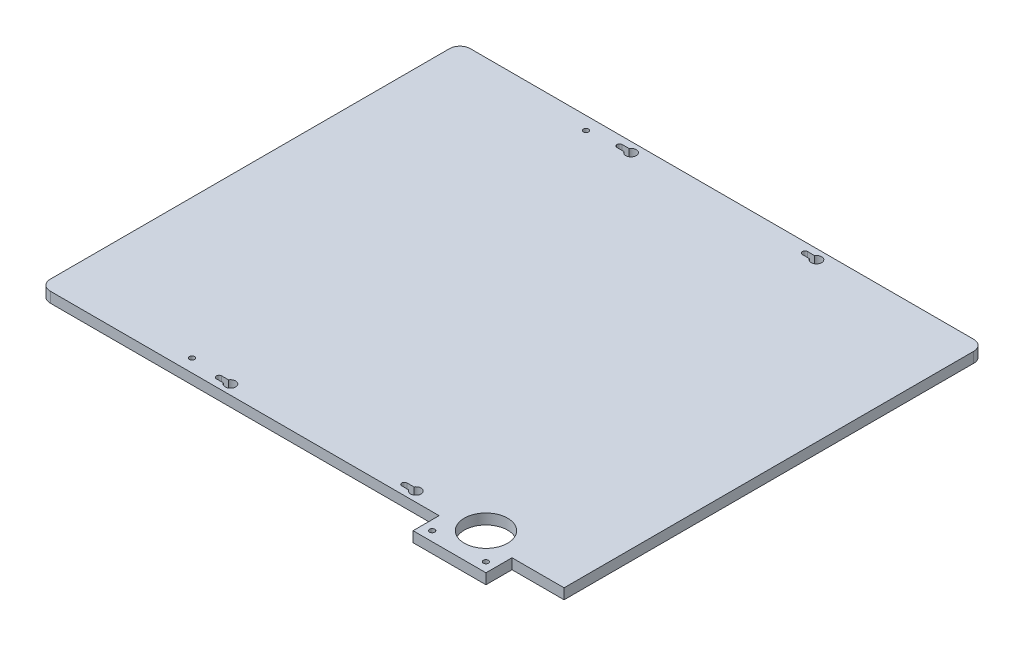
ISO-10303-21;
HEADER;
FILE_DESCRIPTION(('STEP AP214'),'2;1');
FILE_NAME('part.step','',(''),(''),'','','');
FILE_SCHEMA(('AUTOMOTIVE_DESIGN { 1 0 10303 214 1 1 1 1 }'));
ENDSEC;
DATA;
#1=APPLICATION_CONTEXT('core data for automotive mechanical design processes');
#2=APPLICATION_PROTOCOL_DEFINITION('international standard','automotive_design',2000,#1);
#3=PRODUCT_CONTEXT('',#1,'mechanical');
#4=PRODUCT('Part','Part','',(#3));
#5=PRODUCT_RELATED_PRODUCT_CATEGORY('part','',(#4));
#6=PRODUCT_DEFINITION_FORMATION('','',#4);
#7=PRODUCT_DEFINITION_CONTEXT('part definition',#1,'design');
#8=PRODUCT_DEFINITION('design','',#6,#7);
#9=PRODUCT_DEFINITION_SHAPE('','',#8);
#10=(LENGTH_UNIT() NAMED_UNIT(*) SI_UNIT(.MILLI.,.METRE.));
#11=(NAMED_UNIT(*) PLANE_ANGLE_UNIT() SI_UNIT($,.RADIAN.));
#12=(NAMED_UNIT(*) SI_UNIT($,.STERADIAN.) SOLID_ANGLE_UNIT());
#13=UNCERTAINTY_MEASURE_WITH_UNIT(LENGTH_MEASURE(1.E-05),#10,'distance_accuracy_value','');
#14=(GEOMETRIC_REPRESENTATION_CONTEXT(3) GLOBAL_UNCERTAINTY_ASSIGNED_CONTEXT((#13)) GLOBAL_UNIT_ASSIGNED_CONTEXT((#10,
#11,#12)) REPRESENTATION_CONTEXT('',''));
#15=CARTESIAN_POINT('',(0.,0.,0.));
#16=DIRECTION('',(0.,0.,1.));
#17=DIRECTION('',(1.,0.,0.));
#18=AXIS2_PLACEMENT_3D('',#15,#16,#17);
#19=CARTESIAN_POINT('',(0.,-3.,0.));
#20=DIRECTION('',(0.,1.,0.));
#21=DIRECTION('',(0.,0.,1.));
#22=AXIS2_PLACEMENT_3D('',#19,#20,#21);
#23=PLANE('',#22);
#24=DIRECTION('',(1.,0.,0.));
#25=VECTOR('',#24,1.);
#26=CARTESIAN_POINT('',(53.4,-3.,116.9));
#27=LINE('',#26,#25);
#28=CARTESIAN_POINT('',(53.4,-3.,116.9));
#29=VERTEX_POINT('',#28);
#30=CARTESIAN_POINT('',(57.4019237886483,-3.,116.9));
#31=VERTEX_POINT('',#30);
#32=EDGE_CURVE('E263',#29,#31,#27,.T.);
#33=ORIENTED_EDGE('',*,*,#32,.T.);
#34=CARTESIAN_POINT('',(60.,-3.,115.4));
#35=DIRECTION('',(0.,-1.,0.));
#36=DIRECTION('',(0.,0.,-1.));
#37=AXIS2_PLACEMENT_3D('',#34,#35,#36);
#38=CIRCLE('',#37,2.99999999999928);
#39=CARTESIAN_POINT('',(57.4019237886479,-3.,113.899999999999));
#40=VERTEX_POINT('',#39);
#41=EDGE_CURVE('E822',#40,#31,#38,.T.);
#42=ORIENTED_EDGE('',*,*,#41,.F.);
#43=DIRECTION('',(-1.,0.,1.8032451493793E-13));
#44=VECTOR('',#43,1.);
#45=CARTESIAN_POINT('',(57.4019237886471,-3.,113.899999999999));
#46=LINE('',#45,#44);
#47=CARTESIAN_POINT('',(53.4,-3.,113.9));
#48=VERTEX_POINT('',#47);
#49=EDGE_CURVE('E259',#40,#48,#46,.T.);
#50=ORIENTED_EDGE('',*,*,#49,.T.);
#51=CARTESIAN_POINT('',(53.4,-3.,115.4));
#52=DIRECTION('',(0.,1.,0.));
#53=DIRECTION('',(0.,0.,1.));
#54=AXIS2_PLACEMENT_3D('',#51,#52,#53);
#55=CIRCLE('',#54,1.5);
#56=EDGE_CURVE('E272',#48,#29,#55,.T.);
#57=ORIENTED_EDGE('',*,*,#56,.T.);
#58=EDGE_LOOP('',(#33,#42,#50,#57));
#59=FACE_BOUND('',#58,.T.);
#60=DIRECTION('',(1.,0.,0.));
#61=VECTOR('',#60,1.);
#62=CARTESIAN_POINT('',(53.4,-3.,-113.9));
#63=LINE('',#62,#61);
#64=CARTESIAN_POINT('',(53.4,-3.,-113.9));
#65=VERTEX_POINT('',#64);
#66=CARTESIAN_POINT('',(57.4019237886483,-3.,-113.9));
#67=VERTEX_POINT('',#66);
#68=EDGE_CURVE('E315',#65,#67,#63,.T.);
#69=ORIENTED_EDGE('',*,*,#68,.T.);
#70=CARTESIAN_POINT('',(60.,-3.,-115.4));
#71=DIRECTION('',(0.,-1.,0.));
#72=DIRECTION('',(0.,0.,-1.));
#73=AXIS2_PLACEMENT_3D('',#70,#71,#72);
#74=CIRCLE('',#73,2.99999999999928);
#75=CARTESIAN_POINT('',(57.4019237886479,-3.,-116.900000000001));
#76=VERTEX_POINT('',#75);
#77=EDGE_CURVE('E806',#76,#67,#74,.T.);
#78=ORIENTED_EDGE('',*,*,#77,.F.);
#79=DIRECTION('',(-1.,0.,1.8032451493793E-13));
#80=VECTOR('',#79,1.);
#81=CARTESIAN_POINT('',(57.4019237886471,-3.,-116.900000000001));
#82=LINE('',#81,#80);
#83=CARTESIAN_POINT('',(53.4,-3.,-116.9));
#84=VERTEX_POINT('',#83);
#85=EDGE_CURVE('E311',#76,#84,#82,.T.);
#86=ORIENTED_EDGE('',*,*,#85,.T.);
#87=CARTESIAN_POINT('',(53.4,-3.,-115.4));
#88=DIRECTION('',(0.,1.,0.));
#89=DIRECTION('',(0.,0.,1.));
#90=AXIS2_PLACEMENT_3D('',#87,#88,#89);
#91=CIRCLE('',#90,1.5);
#92=EDGE_CURVE('E324',#84,#65,#91,.T.);
#93=ORIENTED_EDGE('',*,*,#92,.T.);
#94=EDGE_LOOP('',(#69,#78,#86,#93));
#95=FACE_BOUND('',#94,.T.);
#96=DIRECTION('',(-1.,0.,0.));
#97=VECTOR('',#96,1.);
#98=CARTESIAN_POINT('',(0.,-3.,-121.));
#99=LINE('',#98,#97);
#100=CARTESIAN_POINT('',(145.,-3.,-121.));
#101=VERTEX_POINT('',#100);
#102=CARTESIAN_POINT('',(-145.,-3.,-121.));
#103=VERTEX_POINT('',#102);
#104=EDGE_CURVE('E348',#101,#103,#99,.T.);
#105=ORIENTED_EDGE('',*,*,#104,.F.);
#106=CARTESIAN_POINT('',(145.,-3.,-115.));
#107=DIRECTION('',(0.,1.,0.));
#108=DIRECTION('',(0.,0.,1.));
#109=AXIS2_PLACEMENT_3D('',#106,#107,#108);
#110=CIRCLE('',#109,6.);
#111=CARTESIAN_POINT('',(151.,-3.,-115.));
#112=VERTEX_POINT('',#111);
#113=EDGE_CURVE('E437',#101,#112,#110,.F.);
#114=ORIENTED_EDGE('',*,*,#113,.T.);
#115=DIRECTION('',(0.,0.,1.));
#116=VECTOR('',#115,1.);
#117=CARTESIAN_POINT('',(151.,-3.,0.));
#118=LINE('',#117,#116);
#119=CARTESIAN_POINT('',(151.,-3.,121.));
#120=VERTEX_POINT('',#119);
#121=EDGE_CURVE('E345',#112,#120,#118,.T.);
#122=ORIENTED_EDGE('',*,*,#121,.T.);
#123=DIRECTION('',(1.,0.,0.));
#124=VECTOR('',#123,1.);
#125=CARTESIAN_POINT('',(0.,-3.,121.));
#126=LINE('',#125,#124);
#127=CARTESIAN_POINT('',(121.,-3.,121.));
#128=VERTEX_POINT('',#127);
#129=EDGE_CURVE('E341',#128,#120,#126,.T.);
#130=ORIENTED_EDGE('',*,*,#129,.F.);
#131=DIRECTION('',(0.,0.,1.));
#132=VECTOR('',#131,1.);
#133=CARTESIAN_POINT('',(121.,-3.,0.));
#134=LINE('',#133,#132);
#135=CARTESIAN_POINT('',(121.,-3.,136.));
#136=VERTEX_POINT('',#135);
#137=EDGE_CURVE('E338',#128,#136,#134,.T.);
#138=ORIENTED_EDGE('',*,*,#137,.T.);
#139=DIRECTION('',(-1.,0.,0.));
#140=VECTOR('',#139,1.);
#141=CARTESIAN_POINT('',(0.,-3.,136.));
#142=LINE('',#141,#140);
#143=CARTESIAN_POINT('',(79.,-3.,136.));
#144=VERTEX_POINT('',#143);
#145=EDGE_CURVE('E356',#136,#144,#142,.T.);
#146=ORIENTED_EDGE('',*,*,#145,.T.);
#147=DIRECTION('',(0.,0.,1.));
#148=VECTOR('',#147,1.);
#149=CARTESIAN_POINT('',(78.9999999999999,-3.,0.));
#150=LINE('',#149,#148);
#151=CARTESIAN_POINT('',(79.,-3.,121.));
#152=VERTEX_POINT('',#151);
#153=EDGE_CURVE('E353',#152,#144,#150,.T.);
#154=ORIENTED_EDGE('',*,*,#153,.F.);
#155=CARTESIAN_POINT('',(-145.,-3.,121.));
#156=VERTEX_POINT('',#155);
#157=EDGE_CURVE('E346',#156,#152,#126,.T.);
#158=ORIENTED_EDGE('',*,*,#157,.F.);
#159=CARTESIAN_POINT('',(-145.,-3.,115.));
#160=DIRECTION('',(0.,1.,0.));
#161=DIRECTION('',(0.,0.,1.));
#162=AXIS2_PLACEMENT_3D('',#159,#160,#161);
#163=CIRCLE('',#162,6.);
#164=CARTESIAN_POINT('',(-151.,-3.,115.));
#165=VERTEX_POINT('',#164);
#166=EDGE_CURVE('E52',#156,#165,#163,.F.);
#167=ORIENTED_EDGE('',*,*,#166,.T.);
#168=DIRECTION('',(0.,0.,1.));
#169=VECTOR('',#168,1.);
#170=CARTESIAN_POINT('',(-151.,-3.,0.));
#171=LINE('',#170,#169);
#172=CARTESIAN_POINT('',(-151.,-3.,-115.));
#173=VERTEX_POINT('',#172);
#174=EDGE_CURVE('E351',#173,#165,#171,.T.);
#175=ORIENTED_EDGE('',*,*,#174,.F.);
#176=CARTESIAN_POINT('',(-145.,-3.,-115.));
#177=DIRECTION('',(0.,1.,0.));
#178=DIRECTION('',(0.,0.,1.));
#179=AXIS2_PLACEMENT_3D('',#176,#177,#178);
#180=CIRCLE('',#179,6.);
#181=EDGE_CURVE('E434',#173,#103,#180,.F.);
#182=ORIENTED_EDGE('',*,*,#181,.T.);
#183=EDGE_LOOP('',(#105,#114,#122,#130,#138,#146,#154,#158,#167,#175,#182));
#184=FACE_BOUND('',#183,.T.);
#185=CARTESIAN_POINT('',(100.,-3.,115.));
#186=DIRECTION('',(0.,1.,0.));
#187=DIRECTION('',(0.,0.,1.));
#188=AXIS2_PLACEMENT_3D('',#185,#186,#187);
#189=CIRCLE('',#188,12.5);
#190=CARTESIAN_POINT('',(100.,-3.,127.5));
#191=VERTEX_POINT('',#190);
#192=EDGE_CURVE('E358',#191,#191,#189,.T.);
#193=ORIENTED_EDGE('',*,*,#192,.T.);
#194=EDGE_LOOP('',(#193));
#195=FACE_BOUND('',#194,.T.);
#196=CARTESIAN_POINT('',(115.5,-3.,130.5));
#197=DIRECTION('',(0.,1.,0.));
#198=DIRECTION('',(0.,0.,1.));
#199=AXIS2_PLACEMENT_3D('',#196,#197,#198);
#200=CIRCLE('',#199,1.5);
#201=CARTESIAN_POINT('',(115.5,-3.,132.));
#202=VERTEX_POINT('',#201);
#203=EDGE_CURVE('E361',#202,#202,#200,.T.);
#204=ORIENTED_EDGE('',*,*,#203,.T.);
#205=EDGE_LOOP('',(#204));
#206=FACE_BOUND('',#205,.T.);
#207=CARTESIAN_POINT('',(84.5,-3.,130.5));
#208=DIRECTION('',(0.,1.,0.));
#209=DIRECTION('',(0.,0.,1.));
#210=AXIS2_PLACEMENT_3D('',#207,#208,#209);
#211=CIRCLE('',#210,1.5);
#212=CARTESIAN_POINT('',(84.5,-3.,132.));
#213=VERTEX_POINT('',#212);
#214=EDGE_CURVE('E364',#213,#213,#211,.T.);
#215=ORIENTED_EDGE('',*,*,#214,.T.);
#216=EDGE_LOOP('',(#215));
#217=FACE_BOUND('',#216,.T.);
#218=CARTESIAN_POINT('',(-70.85,-3.,-113.5));
#219=DIRECTION('',(0.,1.,0.));
#220=DIRECTION('',(0.,0.,1.));
#221=AXIS2_PLACEMENT_3D('',#218,#219,#220);
#222=CIRCLE('',#221,1.5);
#223=CARTESIAN_POINT('',(-70.85,-3.,-112.));
#224=VERTEX_POINT('',#223);
#225=EDGE_CURVE('E367',#224,#224,#222,.T.);
#226=ORIENTED_EDGE('',*,*,#225,.T.);
#227=EDGE_LOOP('',(#226));
#228=FACE_BOUND('',#227,.T.);
#229=CARTESIAN_POINT('',(-70.85,-3.,113.5));
#230=DIRECTION('',(0.,1.,0.));
#231=DIRECTION('',(0.,0.,1.));
#232=AXIS2_PLACEMENT_3D('',#229,#230,#231);
#233=CIRCLE('',#232,1.5);
#234=CARTESIAN_POINT('',(-70.85,-3.,115.));
#235=VERTEX_POINT('',#234);
#236=EDGE_CURVE('E370',#235,#235,#233,.T.);
#237=ORIENTED_EDGE('',*,*,#236,.T.);
#238=EDGE_LOOP('',(#237));
#239=FACE_BOUND('',#238,.T.);
#240=DIRECTION('',(1.,0.,0.));
#241=VECTOR('',#240,1.);
#242=CARTESIAN_POINT('',(-53.4,-3.,-113.9));
#243=LINE('',#242,#241);
#244=CARTESIAN_POINT('',(-53.4,-3.,-113.9));
#245=VERTEX_POINT('',#244);
#246=CARTESIAN_POINT('',(-49.3980762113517,-3.,-113.9));
#247=VERTEX_POINT('',#246);
#248=EDGE_CURVE('E289',#245,#247,#243,.T.);
#249=ORIENTED_EDGE('',*,*,#248,.T.);
#250=CARTESIAN_POINT('',(-46.8,-3.,-115.4));
#251=DIRECTION('',(0.,-1.,0.));
#252=DIRECTION('',(0.,0.,-1.));
#253=AXIS2_PLACEMENT_3D('',#250,#251,#252);
#254=CIRCLE('',#253,2.99999999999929);
#255=CARTESIAN_POINT('',(-49.3980762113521,-3.,-116.900000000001));
#256=VERTEX_POINT('',#255);
#257=EDGE_CURVE('E815',#256,#247,#254,.T.);
#258=ORIENTED_EDGE('',*,*,#257,.F.);
#259=DIRECTION('',(-1.,0.,1.8032451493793E-13));
#260=VECTOR('',#259,1.);
#261=CARTESIAN_POINT('',(-49.3980762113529,-3.,-116.900000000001));
#262=LINE('',#261,#260);
#263=CARTESIAN_POINT('',(-53.4,-3.,-116.9));
#264=VERTEX_POINT('',#263);
#265=EDGE_CURVE('E285',#256,#264,#262,.T.);
#266=ORIENTED_EDGE('',*,*,#265,.T.);
#267=CARTESIAN_POINT('',(-53.4,-3.,-115.4));
#268=DIRECTION('',(0.,1.,0.));
#269=DIRECTION('',(0.,0.,1.));
#270=AXIS2_PLACEMENT_3D('',#267,#268,#269);
#271=CIRCLE('',#270,1.5);
#272=EDGE_CURVE('E298',#264,#245,#271,.T.);
#273=ORIENTED_EDGE('',*,*,#272,.T.);
#274=EDGE_LOOP('',(#249,#258,#266,#273));
#275=FACE_BOUND('',#274,.T.);
#276=DIRECTION('',(-1.,0.,-1.8032451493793E-13));
#277=VECTOR('',#276,1.);
#278=CARTESIAN_POINT('',(-49.3980762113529,-3.,116.900000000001));
#279=LINE('',#278,#277);
#280=CARTESIAN_POINT('',(-49.3980762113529,-3.,116.900000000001));
#281=VERTEX_POINT('',#280);
#282=CARTESIAN_POINT('',(-53.4,-3.,116.9));
#283=VERTEX_POINT('',#282);
#284=EDGE_CURVE('E234',#281,#283,#279,.T.);
#285=ORIENTED_EDGE('',*,*,#284,.F.);
#286=CARTESIAN_POINT('',(-46.8,-3.,115.4));
#287=DIRECTION('',(0.,-1.,0.));
#288=DIRECTION('',(0.,0.,-1.));
#289=AXIS2_PLACEMENT_3D('',#286,#287,#288);
#290=CIRCLE('',#289,2.99999999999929);
#291=CARTESIAN_POINT('',(-49.3980762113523,-3.,113.9));
#292=VERTEX_POINT('',#291);
#293=EDGE_CURVE('E219',#292,#281,#290,.T.);
#294=ORIENTED_EDGE('',*,*,#293,.F.);
#295=DIRECTION('',(1.,0.,-1.8032451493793E-13));
#296=VECTOR('',#295,1.);
#297=CARTESIAN_POINT('',(-53.4,-3.,113.9));
#298=LINE('',#297,#296);
#299=CARTESIAN_POINT('',(-53.4,-3.,113.9));
#300=VERTEX_POINT('',#299);
#301=EDGE_CURVE('E233',#300,#292,#298,.T.);
#302=ORIENTED_EDGE('',*,*,#301,.F.);
#303=CARTESIAN_POINT('',(-53.4,-3.,115.4));
#304=DIRECTION('',(0.,-1.,0.));
#305=DIRECTION('',(0.,0.,-1.));
#306=AXIS2_PLACEMENT_3D('',#303,#304,#305);
#307=CIRCLE('',#306,1.5);
#308=EDGE_CURVE('E239',#283,#300,#307,.T.);
#309=ORIENTED_EDGE('',*,*,#308,.F.);
#310=EDGE_LOOP('',(#285,#294,#302,#309));
#311=FACE_BOUND('',#310,.T.);
#312=ADVANCED_FACE('F37',(#59,#95,#184,#195,#206,#217,#228,#239,#275,#311),#23,.F.);
#313=CARTESIAN_POINT('',(0.,3.,0.));
#314=DIRECTION('',(0.,1.,0.));
#315=DIRECTION('',(0.,0.,1.));
#316=AXIS2_PLACEMENT_3D('',#313,#314,#315);
#317=PLANE('',#316);
#318=CARTESIAN_POINT('',(-46.8,3.,115.4));
#319=DIRECTION('',(0.,-1.,0.));
#320=DIRECTION('',(0.,0.,-1.));
#321=AXIS2_PLACEMENT_3D('',#318,#319,#320);
#322=CIRCLE('',#321,2.99999999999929);
#323=CARTESIAN_POINT('',(-49.3980762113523,3.,113.9));
#324=VERTEX_POINT('',#323);
#325=CARTESIAN_POINT('',(-49.3980762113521,3.,116.900000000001));
#326=VERTEX_POINT('',#325);
#327=EDGE_CURVE('E222',#324,#326,#322,.T.);
#328=ORIENTED_EDGE('',*,*,#327,.T.);
#329=DIRECTION('',(-1.,0.,-1.8032451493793E-13));
#330=VECTOR('',#329,1.);
#331=CARTESIAN_POINT('',(-49.3980762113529,3.,116.900000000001));
#332=LINE('',#331,#330);
#333=CARTESIAN_POINT('',(-53.4,3.,116.9));
#334=VERTEX_POINT('',#333);
#335=EDGE_CURVE('E243',#326,#334,#332,.T.);
#336=ORIENTED_EDGE('',*,*,#335,.T.);
#337=CARTESIAN_POINT('',(-53.4,3.,115.4));
#338=DIRECTION('',(0.,-1.,0.));
#339=DIRECTION('',(0.,0.,-1.));
#340=AXIS2_PLACEMENT_3D('',#337,#338,#339);
#341=CIRCLE('',#340,1.5);
#342=CARTESIAN_POINT('',(-53.4,3.,113.9));
#343=VERTEX_POINT('',#342);
#344=EDGE_CURVE('E247',#334,#343,#341,.T.);
#345=ORIENTED_EDGE('',*,*,#344,.T.);
#346=DIRECTION('',(1.,0.,-1.8032451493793E-13));
#347=VECTOR('',#346,1.);
#348=CARTESIAN_POINT('',(-53.4,3.,113.9));
#349=LINE('',#348,#347);
#350=EDGE_CURVE('E250',#343,#324,#349,.T.);
#351=ORIENTED_EDGE('',*,*,#350,.T.);
#352=EDGE_LOOP('',(#328,#336,#345,#351));
#353=FACE_BOUND('',#352,.T.);
#354=CARTESIAN_POINT('',(60.,3.,115.4));
#355=DIRECTION('',(0.,-1.,0.));
#356=DIRECTION('',(0.,0.,-1.));
#357=AXIS2_PLACEMENT_3D('',#354,#355,#356);
#358=CIRCLE('',#357,2.99999999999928);
#359=CARTESIAN_POINT('',(57.4019237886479,3.,113.899999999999));
#360=VERTEX_POINT('',#359);
#361=CARTESIAN_POINT('',(57.4019237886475,3.,116.9));
#362=VERTEX_POINT('',#361);
#363=EDGE_CURVE('E819',#360,#362,#358,.T.);
#364=ORIENTED_EDGE('',*,*,#363,.T.);
#365=DIRECTION('',(1.,0.,0.));
#366=VECTOR('',#365,1.);
#367=CARTESIAN_POINT('',(53.4,3.,116.9));
#368=LINE('',#367,#366);
#369=CARTESIAN_POINT('',(53.4,3.,116.9));
#370=VERTEX_POINT('',#369);
#371=EDGE_CURVE('E266',#370,#362,#368,.T.);
#372=ORIENTED_EDGE('',*,*,#371,.F.);
#373=CARTESIAN_POINT('',(53.4,3.,115.4));
#374=DIRECTION('',(0.,1.,0.));
#375=DIRECTION('',(0.,0.,1.));
#376=AXIS2_PLACEMENT_3D('',#373,#374,#375);
#377=CIRCLE('',#376,1.5);
#378=CARTESIAN_POINT('',(53.4,3.,113.9));
#379=VERTEX_POINT('',#378);
#380=EDGE_CURVE('E262',#379,#370,#377,.T.);
#381=ORIENTED_EDGE('',*,*,#380,.F.);
#382=DIRECTION('',(-1.,0.,1.8032451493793E-13));
#383=VECTOR('',#382,1.);
#384=CARTESIAN_POINT('',(57.4019237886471,3.,113.899999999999));
#385=LINE('',#384,#383);
#386=EDGE_CURVE('E260',#360,#379,#385,.T.);
#387=ORIENTED_EDGE('',*,*,#386,.F.);
#388=EDGE_LOOP('',(#364,#372,#381,#387));
#389=FACE_BOUND('',#388,.T.);
#390=CARTESIAN_POINT('',(-46.8,3.,-115.4));
#391=DIRECTION('',(0.,-1.,0.));
#392=DIRECTION('',(0.,0.,-1.));
#393=AXIS2_PLACEMENT_3D('',#390,#391,#392);
#394=CIRCLE('',#393,2.99999999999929);
#395=CARTESIAN_POINT('',(-49.3980762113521,3.,-116.900000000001));
#396=VERTEX_POINT('',#395);
#397=CARTESIAN_POINT('',(-49.3980762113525,3.,-113.9));
#398=VERTEX_POINT('',#397);
#399=EDGE_CURVE('E812',#396,#398,#394,.T.);
#400=ORIENTED_EDGE('',*,*,#399,.T.);
#401=DIRECTION('',(1.,0.,0.));
#402=VECTOR('',#401,1.);
#403=CARTESIAN_POINT('',(-53.4,3.,-113.9));
#404=LINE('',#403,#402);
#405=CARTESIAN_POINT('',(-53.4,3.,-113.9));
#406=VERTEX_POINT('',#405);
#407=EDGE_CURVE('E292',#406,#398,#404,.T.);
#408=ORIENTED_EDGE('',*,*,#407,.F.);
#409=CARTESIAN_POINT('',(-53.4,3.,-115.4));
#410=DIRECTION('',(0.,1.,0.));
#411=DIRECTION('',(0.,0.,1.));
#412=AXIS2_PLACEMENT_3D('',#409,#410,#411);
#413=CIRCLE('',#412,1.5);
#414=CARTESIAN_POINT('',(-53.4,3.,-116.9));
#415=VERTEX_POINT('',#414);
#416=EDGE_CURVE('E288',#415,#406,#413,.T.);
#417=ORIENTED_EDGE('',*,*,#416,.F.);
#418=DIRECTION('',(-1.,0.,1.8032451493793E-13));
#419=VECTOR('',#418,1.);
#420=CARTESIAN_POINT('',(-49.3980762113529,3.,-116.900000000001));
#421=LINE('',#420,#419);
#422=EDGE_CURVE('E286',#396,#415,#421,.T.);
#423=ORIENTED_EDGE('',*,*,#422,.F.);
#424=EDGE_LOOP('',(#400,#408,#417,#423));
#425=FACE_BOUND('',#424,.T.);
#426=CARTESIAN_POINT('',(60.,3.,-115.4));
#427=DIRECTION('',(0.,-1.,0.));
#428=DIRECTION('',(0.,0.,-1.));
#429=AXIS2_PLACEMENT_3D('',#426,#427,#428);
#430=CIRCLE('',#429,2.99999999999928);
#431=CARTESIAN_POINT('',(57.4019237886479,3.,-116.900000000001));
#432=VERTEX_POINT('',#431);
#433=CARTESIAN_POINT('',(57.4019237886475,3.,-113.9));
#434=VERTEX_POINT('',#433);
#435=EDGE_CURVE('E251',#432,#434,#430,.T.);
#436=ORIENTED_EDGE('',*,*,#435,.T.);
#437=DIRECTION('',(1.,0.,0.));
#438=VECTOR('',#437,1.);
#439=CARTESIAN_POINT('',(53.4,3.,-113.9));
#440=LINE('',#439,#438);
#441=CARTESIAN_POINT('',(53.4,3.,-113.9));
#442=VERTEX_POINT('',#441);
#443=EDGE_CURVE('E318',#442,#434,#440,.T.);
#444=ORIENTED_EDGE('',*,*,#443,.F.);
#445=CARTESIAN_POINT('',(53.4,3.,-115.4));
#446=DIRECTION('',(0.,1.,0.));
#447=DIRECTION('',(0.,0.,1.));
#448=AXIS2_PLACEMENT_3D('',#445,#446,#447);
#449=CIRCLE('',#448,1.5);
#450=CARTESIAN_POINT('',(53.4,3.,-116.9));
#451=VERTEX_POINT('',#450);
#452=EDGE_CURVE('E314',#451,#442,#449,.T.);
#453=ORIENTED_EDGE('',*,*,#452,.F.);
#454=DIRECTION('',(-1.,0.,1.8032451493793E-13));
#455=VECTOR('',#454,1.);
#456=CARTESIAN_POINT('',(57.4019237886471,3.,-116.900000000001));
#457=LINE('',#456,#455);
#458=EDGE_CURVE('E312',#432,#451,#457,.T.);
#459=ORIENTED_EDGE('',*,*,#458,.F.);
#460=EDGE_LOOP('',(#436,#444,#453,#459));
#461=FACE_BOUND('',#460,.T.);
#462=DIRECTION('',(0.,0.,1.));
#463=VECTOR('',#462,1.);
#464=CARTESIAN_POINT('',(151.,3.,0.));
#465=LINE('',#464,#463);
#466=CARTESIAN_POINT('',(151.,3.,-115.));
#467=VERTEX_POINT('',#466);
#468=CARTESIAN_POINT('',(151.,3.,121.));
#469=VERTEX_POINT('',#468);
#470=EDGE_CURVE('E379',#467,#469,#465,.T.);
#471=ORIENTED_EDGE('',*,*,#470,.F.);
#472=CARTESIAN_POINT('',(145.,3.,-115.));
#473=DIRECTION('',(0.,1.,0.));
#474=DIRECTION('',(0.,0.,1.));
#475=AXIS2_PLACEMENT_3D('',#472,#473,#474);
#476=CIRCLE('',#475,6.);
#477=CARTESIAN_POINT('',(145.,3.,-121.));
#478=VERTEX_POINT('',#477);
#479=EDGE_CURVE('E427',#467,#478,#476,.T.);
#480=ORIENTED_EDGE('',*,*,#479,.T.);
#481=DIRECTION('',(-1.,0.,0.));
#482=VECTOR('',#481,1.);
#483=CARTESIAN_POINT('',(0.,3.,-121.));
#484=LINE('',#483,#482);
#485=CARTESIAN_POINT('',(-145.,3.,-121.));
#486=VERTEX_POINT('',#485);
#487=EDGE_CURVE('E382',#478,#486,#484,.T.);
#488=ORIENTED_EDGE('',*,*,#487,.T.);
#489=CARTESIAN_POINT('',(-145.,3.,-115.));
#490=DIRECTION('',(0.,1.,0.));
#491=DIRECTION('',(0.,0.,1.));
#492=AXIS2_PLACEMENT_3D('',#489,#490,#491);
#493=CIRCLE('',#492,6.);
#494=CARTESIAN_POINT('',(-151.,3.,-115.));
#495=VERTEX_POINT('',#494);
#496=EDGE_CURVE('E423',#486,#495,#493,.T.);
#497=ORIENTED_EDGE('',*,*,#496,.T.);
#498=DIRECTION('',(0.,0.,1.));
#499=VECTOR('',#498,1.);
#500=CARTESIAN_POINT('',(-151.,3.,0.));
#501=LINE('',#500,#499);
#502=CARTESIAN_POINT('',(-151.,3.,115.));
#503=VERTEX_POINT('',#502);
#504=EDGE_CURVE('E385',#495,#503,#501,.T.);
#505=ORIENTED_EDGE('',*,*,#504,.T.);
#506=CARTESIAN_POINT('',(-145.,3.,115.));
#507=DIRECTION('',(0.,1.,0.));
#508=DIRECTION('',(0.,0.,1.));
#509=AXIS2_PLACEMENT_3D('',#506,#507,#508);
#510=CIRCLE('',#509,6.);
#511=CARTESIAN_POINT('',(-145.,3.,121.));
#512=VERTEX_POINT('',#511);
#513=EDGE_CURVE('E425',#503,#512,#510,.T.);
#514=ORIENTED_EDGE('',*,*,#513,.T.);
#515=DIRECTION('',(1.,0.,0.));
#516=VECTOR('',#515,1.);
#517=CARTESIAN_POINT('',(0.,3.,121.));
#518=LINE('',#517,#516);
#519=CARTESIAN_POINT('',(79.,3.,121.));
#520=VERTEX_POINT('',#519);
#521=EDGE_CURVE('E380',#512,#520,#518,.T.);
#522=ORIENTED_EDGE('',*,*,#521,.T.);
#523=DIRECTION('',(0.,0.,1.));
#524=VECTOR('',#523,1.);
#525=CARTESIAN_POINT('',(78.9999999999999,3.,0.));
#526=LINE('',#525,#524);
#527=CARTESIAN_POINT('',(79.,3.,136.));
#528=VERTEX_POINT('',#527);
#529=EDGE_CURVE('E388',#520,#528,#526,.T.);
#530=ORIENTED_EDGE('',*,*,#529,.T.);
#531=DIRECTION('',(-1.,0.,0.));
#532=VECTOR('',#531,1.);
#533=CARTESIAN_POINT('',(0.,3.,136.));
#534=LINE('',#533,#532);
#535=CARTESIAN_POINT('',(121.,3.,136.));
#536=VERTEX_POINT('',#535);
#537=EDGE_CURVE('E391',#536,#528,#534,.T.);
#538=ORIENTED_EDGE('',*,*,#537,.F.);
#539=DIRECTION('',(0.,0.,1.));
#540=VECTOR('',#539,1.);
#541=CARTESIAN_POINT('',(121.,3.,0.));
#542=LINE('',#541,#540);
#543=CARTESIAN_POINT('',(121.,3.,121.));
#544=VERTEX_POINT('',#543);
#545=EDGE_CURVE('E337',#544,#536,#542,.T.);
#546=ORIENTED_EDGE('',*,*,#545,.F.);
#547=EDGE_CURVE('E376',#544,#469,#518,.T.);
#548=ORIENTED_EDGE('',*,*,#547,.T.);
#549=EDGE_LOOP('',(#471,#480,#488,#497,#505,#514,#522,#530,#538,#546,#548));
#550=FACE_BOUND('',#549,.T.);
#551=CARTESIAN_POINT('',(100.,3.,115.));
#552=DIRECTION('',(0.,1.,0.));
#553=DIRECTION('',(0.,0.,1.));
#554=AXIS2_PLACEMENT_3D('',#551,#552,#553);
#555=CIRCLE('',#554,12.5);
#556=CARTESIAN_POINT('',(100.,3.,127.5));
#557=VERTEX_POINT('',#556);
#558=EDGE_CURVE('E394',#557,#557,#555,.T.);
#559=ORIENTED_EDGE('',*,*,#558,.F.);
#560=EDGE_LOOP('',(#559));
#561=FACE_BOUND('',#560,.T.);
#562=CARTESIAN_POINT('',(115.5,3.,130.5));
#563=DIRECTION('',(0.,1.,0.));
#564=DIRECTION('',(0.,0.,1.));
#565=AXIS2_PLACEMENT_3D('',#562,#563,#564);
#566=CIRCLE('',#565,1.5);
#567=CARTESIAN_POINT('',(115.5,3.,132.));
#568=VERTEX_POINT('',#567);
#569=EDGE_CURVE('E397',#568,#568,#566,.T.);
#570=ORIENTED_EDGE('',*,*,#569,.F.);
#571=EDGE_LOOP('',(#570));
#572=FACE_BOUND('',#571,.T.);
#573=CARTESIAN_POINT('',(84.5,3.,130.5));
#574=DIRECTION('',(0.,1.,0.));
#575=DIRECTION('',(0.,0.,1.));
#576=AXIS2_PLACEMENT_3D('',#573,#574,#575);
#577=CIRCLE('',#576,1.5);
#578=CARTESIAN_POINT('',(84.5,3.,132.));
#579=VERTEX_POINT('',#578);
#580=EDGE_CURVE('E400',#579,#579,#577,.T.);
#581=ORIENTED_EDGE('',*,*,#580,.F.);
#582=EDGE_LOOP('',(#581));
#583=FACE_BOUND('',#582,.T.);
#584=CARTESIAN_POINT('',(-70.85,3.,-113.5));
#585=DIRECTION('',(0.,1.,0.));
#586=DIRECTION('',(0.,0.,1.));
#587=AXIS2_PLACEMENT_3D('',#584,#585,#586);
#588=CIRCLE('',#587,1.5);
#589=CARTESIAN_POINT('',(-70.85,3.,-112.));
#590=VERTEX_POINT('',#589);
#591=EDGE_CURVE('E403',#590,#590,#588,.T.);
#592=ORIENTED_EDGE('',*,*,#591,.F.);
#593=EDGE_LOOP('',(#592));
#594=FACE_BOUND('',#593,.T.);
#595=CARTESIAN_POINT('',(-70.85,3.,113.5));
#596=DIRECTION('',(0.,1.,0.));
#597=DIRECTION('',(0.,0.,1.));
#598=AXIS2_PLACEMENT_3D('',#595,#596,#597);
#599=CIRCLE('',#598,1.5);
#600=CARTESIAN_POINT('',(-70.85,3.,115.));
#601=VERTEX_POINT('',#600);
#602=EDGE_CURVE('E342',#601,#601,#599,.T.);
#603=ORIENTED_EDGE('',*,*,#602,.F.);
#604=EDGE_LOOP('',(#603));
#605=FACE_BOUND('',#604,.T.);
#606=ADVANCED_FACE('F445',(#353,#389,#425,#461,#550,#561,#572,#583,#594,#605),#317,.T.);
#607=CARTESIAN_POINT('',(121.,-3.,0.));
#608=DIRECTION('',(-1.,0.,0.));
#609=DIRECTION('',(0.,0.,1.));
#610=AXIS2_PLACEMENT_3D('',#607,#608,#609);
#611=PLANE('',#610);
#612=ORIENTED_EDGE('',*,*,#545,.T.);
#613=DIRECTION('',(0.,1.,0.));
#614=VECTOR('',#613,1.);
#615=CARTESIAN_POINT('',(121.,-3.,136.));
#616=LINE('',#615,#614);
#617=EDGE_CURVE('E408',#136,#536,#616,.T.);
#618=ORIENTED_EDGE('',*,*,#617,.F.);
#619=ORIENTED_EDGE('',*,*,#137,.F.);
#620=DIRECTION('',(0.,1.,0.));
#621=VECTOR('',#620,1.);
#622=CARTESIAN_POINT('',(121.,-3.,121.));
#623=LINE('',#622,#621);
#624=EDGE_CURVE('E373',#128,#544,#623,.T.);
#625=ORIENTED_EDGE('',*,*,#624,.T.);
#626=EDGE_LOOP('',(#612,#618,#619,#625));
#627=FACE_BOUND('',#626,.T.);
#628=ADVANCED_FACE('F475',(#627),#611,.F.);
#629=CARTESIAN_POINT('',(0.,-3.,136.));
#630=DIRECTION('',(0.,0.,-1.));
#631=DIRECTION('',(-1.,0.,0.));
#632=AXIS2_PLACEMENT_3D('',#629,#630,#631);
#633=PLANE('',#632);
#634=ORIENTED_EDGE('',*,*,#537,.T.);
#635=DIRECTION('',(0.,1.,0.));
#636=VECTOR('',#635,1.);
#637=CARTESIAN_POINT('',(79.,-3.,136.));
#638=LINE('',#637,#636);
#639=EDGE_CURVE('E412',#144,#528,#638,.T.);
#640=ORIENTED_EDGE('',*,*,#639,.F.);
#641=ORIENTED_EDGE('',*,*,#145,.F.);
#642=ORIENTED_EDGE('',*,*,#617,.T.);
#643=EDGE_LOOP('',(#634,#640,#641,#642));
#644=FACE_BOUND('',#643,.T.);
#645=ADVANCED_FACE('F477',(#644),#633,.F.);
#646=CARTESIAN_POINT('',(78.9999999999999,-3.,0.));
#647=DIRECTION('',(-1.,0.,0.));
#648=DIRECTION('',(0.,0.,1.));
#649=AXIS2_PLACEMENT_3D('',#646,#647,#648);
#650=PLANE('',#649);
#651=ORIENTED_EDGE('',*,*,#529,.F.);
#652=DIRECTION('',(0.,1.,0.));
#653=VECTOR('',#652,1.);
#654=CARTESIAN_POINT('',(79.,-3.,121.));
#655=LINE('',#654,#653);
#656=EDGE_CURVE('E414',#152,#520,#655,.T.);
#657=ORIENTED_EDGE('',*,*,#656,.F.);
#658=ORIENTED_EDGE('',*,*,#153,.T.);
#659=ORIENTED_EDGE('',*,*,#639,.T.);
#660=EDGE_LOOP('',(#651,#657,#658,#659));
#661=FACE_BOUND('',#660,.T.);
#662=ADVANCED_FACE('F481',(#661),#650,.T.);
#663=CARTESIAN_POINT('',(0.,-3.,121.));
#664=DIRECTION('',(0.,0.,1.));
#665=DIRECTION('',(1.,0.,0.));
#666=AXIS2_PLACEMENT_3D('',#663,#664,#665);
#667=PLANE('',#666);
#668=ORIENTED_EDGE('',*,*,#521,.F.);
#669=DIRECTION('',(0.,1.,0.));
#670=VECTOR('',#669,1.);
#671=CARTESIAN_POINT('',(-145.,-3.,121.));
#672=LINE('',#671,#670);
#673=EDGE_CURVE('E11',#512,#156,#672,.F.);
#674=ORIENTED_EDGE('',*,*,#673,.T.);
#675=ORIENTED_EDGE('',*,*,#157,.T.);
#676=ORIENTED_EDGE('',*,*,#656,.T.);
#677=EDGE_LOOP('',(#668,#674,#675,#676));
#678=FACE_BOUND('',#677,.T.);
#679=ADVANCED_FACE('F485',(#678),#667,.T.);
#680=CARTESIAN_POINT('',(-151.,-3.,0.));
#681=DIRECTION('',(-1.,0.,0.));
#682=DIRECTION('',(0.,0.,1.));
#683=AXIS2_PLACEMENT_3D('',#680,#681,#682);
#684=PLANE('',#683);
#685=ORIENTED_EDGE('',*,*,#174,.T.);
#686=DIRECTION('',(0.,1.,0.));
#687=VECTOR('',#686,1.);
#688=CARTESIAN_POINT('',(-151.,-3.,115.));
#689=LINE('',#688,#687);
#690=EDGE_CURVE('E45',#165,#503,#689,.T.);
#691=ORIENTED_EDGE('',*,*,#690,.T.);
#692=ORIENTED_EDGE('',*,*,#504,.F.);
#693=DIRECTION('',(0.,1.,0.));
#694=VECTOR('',#693,1.);
#695=CARTESIAN_POINT('',(-151.,-3.,-115.));
#696=LINE('',#695,#694);
#697=EDGE_CURVE('E59',#495,#173,#696,.F.);
#698=ORIENTED_EDGE('',*,*,#697,.T.);
#699=EDGE_LOOP('',(#685,#691,#692,#698));
#700=FACE_BOUND('',#699,.T.);
#701=ADVANCED_FACE('F441',(#700),#684,.T.);
#702=CARTESIAN_POINT('',(0.,-3.,-121.));
#703=DIRECTION('',(0.,0.,-1.));
#704=DIRECTION('',(-1.,0.,0.));
#705=AXIS2_PLACEMENT_3D('',#702,#703,#704);
#706=PLANE('',#705);
#707=ORIENTED_EDGE('',*,*,#487,.F.);
#708=DIRECTION('',(0.,1.,0.));
#709=VECTOR('',#708,1.);
#710=CARTESIAN_POINT('',(145.,-3.,-121.));
#711=LINE('',#710,#709);
#712=EDGE_CURVE('E432',#478,#101,#711,.F.);
#713=ORIENTED_EDGE('',*,*,#712,.T.);
#714=ORIENTED_EDGE('',*,*,#104,.T.);
#715=DIRECTION('',(0.,1.,0.));
#716=VECTOR('',#715,1.);
#717=CARTESIAN_POINT('',(-145.,-3.,-121.));
#718=LINE('',#717,#716);
#719=EDGE_CURVE('E429',#103,#486,#718,.T.);
#720=ORIENTED_EDGE('',*,*,#719,.T.);
#721=EDGE_LOOP('',(#707,#713,#714,#720));
#722=FACE_BOUND('',#721,.T.);
#723=ADVANCED_FACE('F453',(#722),#706,.T.);
#724=CARTESIAN_POINT('',(151.,-3.,0.));
#725=DIRECTION('',(-1.,0.,0.));
#726=DIRECTION('',(0.,0.,1.));
#727=AXIS2_PLACEMENT_3D('',#724,#725,#726);
#728=PLANE('',#727);
#729=ORIENTED_EDGE('',*,*,#121,.F.);
#730=DIRECTION('',(0.,1.,0.));
#731=VECTOR('',#730,1.);
#732=CARTESIAN_POINT('',(151.,3.,-115.));
#733=LINE('',#732,#731);
#734=EDGE_CURVE('E411',#112,#467,#733,.T.);
#735=ORIENTED_EDGE('',*,*,#734,.T.);
#736=ORIENTED_EDGE('',*,*,#470,.T.);
#737=DIRECTION('',(0.,1.,0.));
#738=VECTOR('',#737,1.);
#739=CARTESIAN_POINT('',(151.,-3.,121.));
#740=LINE('',#739,#738);
#741=EDGE_CURVE('E417',#120,#469,#740,.T.);
#742=ORIENTED_EDGE('',*,*,#741,.F.);
#743=EDGE_LOOP('',(#729,#735,#736,#742));
#744=FACE_BOUND('',#743,.T.);
#745=ADVANCED_FACE('F463',(#744),#728,.F.);
#746=CARTESIAN_POINT('',(-70.85,-3.,-113.5));
#747=DIRECTION('',(0.,1.,0.));
#748=DIRECTION('',(0.,0.,1.));
#749=AXIS2_PLACEMENT_3D('',#746,#747,#748);
#750=CYLINDRICAL_SURFACE('',#749,1.5);
#751=ORIENTED_EDGE('',*,*,#225,.F.);
#752=EDGE_LOOP('',(#751));
#753=FACE_BOUND('',#752,.T.);
#754=ORIENTED_EDGE('',*,*,#591,.T.);
#755=EDGE_LOOP('',(#754));
#756=FACE_BOUND('',#755,.T.);
#757=ADVANCED_FACE('F513',(#753,#756),#750,.F.);
#758=CARTESIAN_POINT('',(84.5,-3.,130.5));
#759=DIRECTION('',(0.,1.,0.));
#760=DIRECTION('',(0.,0.,1.));
#761=AXIS2_PLACEMENT_3D('',#758,#759,#760);
#762=CYLINDRICAL_SURFACE('',#761,1.5);
#763=ORIENTED_EDGE('',*,*,#214,.F.);
#764=EDGE_LOOP('',(#763));
#765=FACE_BOUND('',#764,.T.);
#766=ORIENTED_EDGE('',*,*,#580,.T.);
#767=EDGE_LOOP('',(#766));
#768=FACE_BOUND('',#767,.T.);
#769=ADVANCED_FACE('F516',(#765,#768),#762,.F.);
#770=CARTESIAN_POINT('',(115.5,-3.,130.5));
#771=DIRECTION('',(0.,1.,0.));
#772=DIRECTION('',(0.,0.,1.));
#773=AXIS2_PLACEMENT_3D('',#770,#771,#772);
#774=CYLINDRICAL_SURFACE('',#773,1.5);
#775=ORIENTED_EDGE('',*,*,#203,.F.);
#776=EDGE_LOOP('',(#775));
#777=FACE_BOUND('',#776,.T.);
#778=ORIENTED_EDGE('',*,*,#569,.T.);
#779=EDGE_LOOP('',(#778));
#780=FACE_BOUND('',#779,.T.);
#781=ADVANCED_FACE('F520',(#777,#780),#774,.F.);
#782=CARTESIAN_POINT('',(100.,-3.,115.));
#783=DIRECTION('',(0.,1.,0.));
#784=DIRECTION('',(0.,0.,1.));
#785=AXIS2_PLACEMENT_3D('',#782,#783,#784);
#786=CYLINDRICAL_SURFACE('',#785,12.5);
#787=ORIENTED_EDGE('',*,*,#192,.F.);
#788=EDGE_LOOP('',(#787));
#789=FACE_BOUND('',#788,.T.);
#790=ORIENTED_EDGE('',*,*,#558,.T.);
#791=EDGE_LOOP('',(#790));
#792=FACE_BOUND('',#791,.T.);
#793=ADVANCED_FACE('F496',(#789,#792),#786,.F.);
#794=ORIENTED_EDGE('',*,*,#547,.F.);
#795=ORIENTED_EDGE('',*,*,#624,.F.);
#796=ORIENTED_EDGE('',*,*,#129,.T.);
#797=ORIENTED_EDGE('',*,*,#741,.T.);
#798=EDGE_LOOP('',(#794,#795,#796,#797));
#799=FACE_BOUND('',#798,.T.);
#800=ADVANCED_FACE('F468',(#799),#667,.T.);
#801=CARTESIAN_POINT('',(-70.85,-3.,113.5));
#802=DIRECTION('',(0.,1.,0.));
#803=DIRECTION('',(0.,0.,1.));
#804=AXIS2_PLACEMENT_3D('',#801,#802,#803);
#805=CYLINDRICAL_SURFACE('',#804,1.5);
#806=ORIENTED_EDGE('',*,*,#236,.F.);
#807=EDGE_LOOP('',(#806));
#808=FACE_BOUND('',#807,.T.);
#809=ORIENTED_EDGE('',*,*,#602,.T.);
#810=EDGE_LOOP('',(#809));
#811=FACE_BOUND('',#810,.T.);
#812=ADVANCED_FACE('F495',(#808,#811),#805,.F.);
#813=CARTESIAN_POINT('',(57.4019237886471,3.,-116.900000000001));
#814=DIRECTION('',(1.8032451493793E-13,0.,1.));
#815=DIRECTION('',(1.,0.,-1.8032451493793E-13));
#816=AXIS2_PLACEMENT_3D('',#813,#814,#815);
#817=PLANE('',#816);
#818=ORIENTED_EDGE('',*,*,#85,.F.);
#819=DIRECTION('',(0.,-1.,0.));
#820=VECTOR('',#819,1.);
#821=CARTESIAN_POINT('',(57.4019237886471,3.,-116.900000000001));
#822=LINE('',#821,#820);
#823=EDGE_CURVE('E335',#432,#76,#822,.T.);
#824=ORIENTED_EDGE('',*,*,#823,.F.);
#825=ORIENTED_EDGE('',*,*,#458,.T.);
#826=DIRECTION('',(0.,-1.,0.));
#827=VECTOR('',#826,1.);
#828=CARTESIAN_POINT('',(53.4,3.,-116.9));
#829=LINE('',#828,#827);
#830=EDGE_CURVE('E333',#451,#84,#829,.T.);
#831=ORIENTED_EDGE('',*,*,#830,.T.);
#832=EDGE_LOOP('',(#818,#824,#825,#831));
#833=FACE_BOUND('',#832,.T.);
#834=ADVANCED_FACE('F507',(#833),#817,.T.);
#835=CARTESIAN_POINT('',(53.4,3.,-115.4));
#836=DIRECTION('',(0.,-1.,0.));
#837=DIRECTION('',(0.,0.,-1.));
#838=AXIS2_PLACEMENT_3D('',#835,#836,#837);
#839=CYLINDRICAL_SURFACE('',#838,1.5);
#840=ORIENTED_EDGE('',*,*,#92,.F.);
#841=ORIENTED_EDGE('',*,*,#830,.F.);
#842=ORIENTED_EDGE('',*,*,#452,.T.);
#843=DIRECTION('',(0.,-1.,0.));
#844=VECTOR('',#843,1.);
#845=CARTESIAN_POINT('',(53.4,3.,-113.9));
#846=LINE('',#845,#844);
#847=EDGE_CURVE('E331',#442,#65,#846,.T.);
#848=ORIENTED_EDGE('',*,*,#847,.T.);
#849=EDGE_LOOP('',(#840,#841,#842,#848));
#850=FACE_BOUND('',#849,.T.);
#851=ADVANCED_FACE('F710',(#850),#839,.F.);
#852=CARTESIAN_POINT('',(53.4,3.,-113.9));
#853=DIRECTION('',(0.,0.,-1.));
#854=DIRECTION('',(-1.,0.,0.));
#855=AXIS2_PLACEMENT_3D('',#852,#853,#854);
#856=PLANE('',#855);
#857=ORIENTED_EDGE('',*,*,#68,.F.);
#858=ORIENTED_EDGE('',*,*,#847,.F.);
#859=ORIENTED_EDGE('',*,*,#443,.T.);
#860=DIRECTION('',(0.,-1.,0.));
#861=VECTOR('',#860,1.);
#862=CARTESIAN_POINT('',(57.4019237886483,3.,-113.9));
#863=LINE('',#862,#861);
#864=EDGE_CURVE('E321',#434,#67,#863,.T.);
#865=ORIENTED_EDGE('',*,*,#864,.T.);
#866=EDGE_LOOP('',(#857,#858,#859,#865));
#867=FACE_BOUND('',#866,.T.);
#868=ADVANCED_FACE('F693',(#867),#856,.T.);
#869=CARTESIAN_POINT('',(-49.3980762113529,3.,-116.900000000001));
#870=DIRECTION('',(1.8032451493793E-13,0.,1.));
#871=DIRECTION('',(1.,0.,-1.8032451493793E-13));
#872=AXIS2_PLACEMENT_3D('',#869,#870,#871);
#873=PLANE('',#872);
#874=ORIENTED_EDGE('',*,*,#265,.F.);
#875=DIRECTION('',(0.,-1.,0.));
#876=VECTOR('',#875,1.);
#877=CARTESIAN_POINT('',(-49.3980762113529,3.,-116.900000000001));
#878=LINE('',#877,#876);
#879=EDGE_CURVE('E309',#396,#256,#878,.T.);
#880=ORIENTED_EDGE('',*,*,#879,.F.);
#881=ORIENTED_EDGE('',*,*,#422,.T.);
#882=DIRECTION('',(0.,-1.,0.));
#883=VECTOR('',#882,1.);
#884=CARTESIAN_POINT('',(-53.4,3.,-116.9));
#885=LINE('',#884,#883);
#886=EDGE_CURVE('E307',#415,#264,#885,.T.);
#887=ORIENTED_EDGE('',*,*,#886,.T.);
#888=EDGE_LOOP('',(#874,#880,#881,#887));
#889=FACE_BOUND('',#888,.T.);
#890=ADVANCED_FACE('F688',(#889),#873,.T.);
#891=CARTESIAN_POINT('',(-53.4,3.,-115.4));
#892=DIRECTION('',(0.,-1.,0.));
#893=DIRECTION('',(0.,0.,-1.));
#894=AXIS2_PLACEMENT_3D('',#891,#892,#893);
#895=CYLINDRICAL_SURFACE('',#894,1.5);
#896=ORIENTED_EDGE('',*,*,#272,.F.);
#897=ORIENTED_EDGE('',*,*,#886,.F.);
#898=ORIENTED_EDGE('',*,*,#416,.T.);
#899=DIRECTION('',(0.,-1.,0.));
#900=VECTOR('',#899,1.);
#901=CARTESIAN_POINT('',(-53.4,3.,-113.9));
#902=LINE('',#901,#900);
#903=EDGE_CURVE('E305',#406,#245,#902,.T.);
#904=ORIENTED_EDGE('',*,*,#903,.T.);
#905=EDGE_LOOP('',(#896,#897,#898,#904));
#906=FACE_BOUND('',#905,.T.);
#907=ADVANCED_FACE('F680',(#906),#895,.F.);
#908=CARTESIAN_POINT('',(-53.4,3.,-113.9));
#909=DIRECTION('',(0.,0.,-1.));
#910=DIRECTION('',(-1.,0.,0.));
#911=AXIS2_PLACEMENT_3D('',#908,#909,#910);
#912=PLANE('',#911);
#913=ORIENTED_EDGE('',*,*,#248,.F.);
#914=ORIENTED_EDGE('',*,*,#903,.F.);
#915=ORIENTED_EDGE('',*,*,#407,.T.);
#916=DIRECTION('',(0.,-1.,0.));
#917=VECTOR('',#916,1.);
#918=CARTESIAN_POINT('',(-49.3980762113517,3.,-113.9));
#919=LINE('',#918,#917);
#920=EDGE_CURVE('E295',#398,#247,#919,.T.);
#921=ORIENTED_EDGE('',*,*,#920,.T.);
#922=EDGE_LOOP('',(#913,#914,#915,#921));
#923=FACE_BOUND('',#922,.T.);
#924=ADVANCED_FACE('F663',(#923),#912,.T.);
#925=CARTESIAN_POINT('',(57.4019237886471,3.,113.899999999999));
#926=DIRECTION('',(1.8032451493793E-13,0.,1.));
#927=DIRECTION('',(1.,0.,-1.8032451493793E-13));
#928=AXIS2_PLACEMENT_3D('',#925,#926,#927);
#929=PLANE('',#928);
#930=ORIENTED_EDGE('',*,*,#49,.F.);
#931=DIRECTION('',(0.,-1.,0.));
#932=VECTOR('',#931,1.);
#933=CARTESIAN_POINT('',(57.4019237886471,3.,113.899999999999));
#934=LINE('',#933,#932);
#935=EDGE_CURVE('E283',#360,#40,#934,.T.);
#936=ORIENTED_EDGE('',*,*,#935,.F.);
#937=ORIENTED_EDGE('',*,*,#386,.T.);
#938=DIRECTION('',(0.,-1.,0.));
#939=VECTOR('',#938,1.);
#940=CARTESIAN_POINT('',(53.4,3.,113.9));
#941=LINE('',#940,#939);
#942=EDGE_CURVE('E281',#379,#48,#941,.T.);
#943=ORIENTED_EDGE('',*,*,#942,.T.);
#944=EDGE_LOOP('',(#930,#936,#937,#943));
#945=FACE_BOUND('',#944,.T.);
#946=ADVANCED_FACE('F658',(#945),#929,.T.);
#947=CARTESIAN_POINT('',(53.4,3.,115.4));
#948=DIRECTION('',(0.,-1.,0.));
#949=DIRECTION('',(0.,0.,-1.));
#950=AXIS2_PLACEMENT_3D('',#947,#948,#949);
#951=CYLINDRICAL_SURFACE('',#950,1.5);
#952=ORIENTED_EDGE('',*,*,#56,.F.);
#953=ORIENTED_EDGE('',*,*,#942,.F.);
#954=ORIENTED_EDGE('',*,*,#380,.T.);
#955=DIRECTION('',(0.,-1.,0.));
#956=VECTOR('',#955,1.);
#957=CARTESIAN_POINT('',(53.4,3.,116.9));
#958=LINE('',#957,#956);
#959=EDGE_CURVE('E279',#370,#29,#958,.T.);
#960=ORIENTED_EDGE('',*,*,#959,.T.);
#961=EDGE_LOOP('',(#952,#953,#954,#960));
#962=FACE_BOUND('',#961,.T.);
#963=ADVANCED_FACE('F649',(#962),#951,.F.);
#964=CARTESIAN_POINT('',(53.4,3.,116.9));
#965=DIRECTION('',(0.,0.,-1.));
#966=DIRECTION('',(-1.,0.,0.));
#967=AXIS2_PLACEMENT_3D('',#964,#965,#966);
#968=PLANE('',#967);
#969=ORIENTED_EDGE('',*,*,#32,.F.);
#970=ORIENTED_EDGE('',*,*,#959,.F.);
#971=ORIENTED_EDGE('',*,*,#371,.T.);
#972=DIRECTION('',(0.,-1.,0.));
#973=VECTOR('',#972,1.);
#974=CARTESIAN_POINT('',(57.4019237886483,3.,116.9));
#975=LINE('',#974,#973);
#976=EDGE_CURVE('E269',#362,#31,#975,.T.);
#977=ORIENTED_EDGE('',*,*,#976,.T.);
#978=EDGE_LOOP('',(#969,#970,#971,#977));
#979=FACE_BOUND('',#978,.T.);
#980=ADVANCED_FACE('F644',(#979),#968,.T.);
#981=CARTESIAN_POINT('',(-53.4,-3.,115.4));
#982=DIRECTION('',(0.,1.,0.));
#983=DIRECTION('',(0.,0.,1.));
#984=AXIS2_PLACEMENT_3D('',#981,#982,#983);
#985=CYLINDRICAL_SURFACE('',#984,1.5);
#986=ORIENTED_EDGE('',*,*,#344,.F.);
#987=DIRECTION('',(0.,1.,0.));
#988=VECTOR('',#987,1.);
#989=CARTESIAN_POINT('',(-53.4,-3.,116.9));
#990=LINE('',#989,#988);
#991=EDGE_CURVE('E241',#283,#334,#990,.T.);
#992=ORIENTED_EDGE('',*,*,#991,.F.);
#993=ORIENTED_EDGE('',*,*,#308,.T.);
#994=DIRECTION('',(0.,1.,0.));
#995=VECTOR('',#994,1.);
#996=CARTESIAN_POINT('',(-53.4,-3.,113.9));
#997=LINE('',#996,#995);
#998=EDGE_CURVE('E226',#300,#343,#997,.T.);
#999=ORIENTED_EDGE('',*,*,#998,.T.);
#1000=EDGE_LOOP('',(#986,#992,#993,#999));
#1001=FACE_BOUND('',#1000,.T.);
#1002=ADVANCED_FACE('F628',(#1001),#985,.F.);
#1003=CARTESIAN_POINT('',(-53.4,-3.,113.9));
#1004=DIRECTION('',(1.8032451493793E-13,0.,1.));
#1005=DIRECTION('',(1.,0.,-1.8032451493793E-13));
#1006=AXIS2_PLACEMENT_3D('',#1003,#1004,#1005);
#1007=PLANE('',#1006);
#1008=ORIENTED_EDGE('',*,*,#350,.F.);
#1009=ORIENTED_EDGE('',*,*,#998,.F.);
#1010=ORIENTED_EDGE('',*,*,#301,.T.);
#1011=DIRECTION('',(0.,1.,0.));
#1012=VECTOR('',#1011,1.);
#1013=CARTESIAN_POINT('',(-49.3980762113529,-3.,113.899999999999));
#1014=LINE('',#1013,#1012);
#1015=EDGE_CURVE('E216',#292,#324,#1014,.T.);
#1016=ORIENTED_EDGE('',*,*,#1015,.T.);
#1017=EDGE_LOOP('',(#1008,#1009,#1010,#1016));
#1018=FACE_BOUND('',#1017,.T.);
#1019=ADVANCED_FACE('F237',(#1018),#1007,.T.);
#1020=CARTESIAN_POINT('',(-49.3980762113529,-3.,116.900000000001));
#1021=DIRECTION('',(1.8032451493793E-13,0.,-1.));
#1022=DIRECTION('',(-1.,0.,-1.8032451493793E-13));
#1023=AXIS2_PLACEMENT_3D('',#1020,#1021,#1022);
#1024=PLANE('',#1023);
#1025=ORIENTED_EDGE('',*,*,#335,.F.);
#1026=DIRECTION('',(0.,1.,0.));
#1027=VECTOR('',#1026,1.);
#1028=CARTESIAN_POINT('',(-49.3980762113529,-3.,116.900000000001));
#1029=LINE('',#1028,#1027);
#1030=EDGE_CURVE('E227',#281,#326,#1029,.T.);
#1031=ORIENTED_EDGE('',*,*,#1030,.F.);
#1032=ORIENTED_EDGE('',*,*,#284,.T.);
#1033=ORIENTED_EDGE('',*,*,#991,.T.);
#1034=EDGE_LOOP('',(#1025,#1031,#1032,#1033));
#1035=FACE_BOUND('',#1034,.T.);
#1036=ADVANCED_FACE('F611',(#1035),#1024,.T.);
#1037=CARTESIAN_POINT('',(60.,3.,-115.4));
#1038=DIRECTION('',(0.,-1.,0.));
#1039=DIRECTION('',(0.,0.,-1.));
#1040=AXIS2_PLACEMENT_3D('',#1037,#1038,#1039);
#1041=CYLINDRICAL_SURFACE('',#1040,2.99999999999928);
#1042=ORIENTED_EDGE('',*,*,#823,.T.);
#1043=ORIENTED_EDGE('',*,*,#77,.T.);
#1044=ORIENTED_EDGE('',*,*,#864,.F.);
#1045=ORIENTED_EDGE('',*,*,#435,.F.);
#1046=EDGE_LOOP('',(#1042,#1043,#1044,#1045));
#1047=FACE_BOUND('',#1046,.T.);
#1048=ADVANCED_FACE('F616',(#1047),#1041,.F.);
#1049=CARTESIAN_POINT('',(-46.8,3.,-115.4));
#1050=DIRECTION('',(0.,-1.,0.));
#1051=DIRECTION('',(0.,0.,-1.));
#1052=AXIS2_PLACEMENT_3D('',#1049,#1050,#1051);
#1053=CYLINDRICAL_SURFACE('',#1052,2.99999999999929);
#1054=ORIENTED_EDGE('',*,*,#879,.T.);
#1055=ORIENTED_EDGE('',*,*,#257,.T.);
#1056=ORIENTED_EDGE('',*,*,#920,.F.);
#1057=ORIENTED_EDGE('',*,*,#399,.F.);
#1058=EDGE_LOOP('',(#1054,#1055,#1056,#1057));
#1059=FACE_BOUND('',#1058,.T.);
#1060=ADVANCED_FACE('F636',(#1059),#1053,.F.);
#1061=CARTESIAN_POINT('',(60.,3.,115.4));
#1062=DIRECTION('',(0.,-1.,0.));
#1063=DIRECTION('',(0.,0.,-1.));
#1064=AXIS2_PLACEMENT_3D('',#1061,#1062,#1063);
#1065=CYLINDRICAL_SURFACE('',#1064,2.99999999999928);
#1066=ORIENTED_EDGE('',*,*,#935,.T.);
#1067=ORIENTED_EDGE('',*,*,#41,.T.);
#1068=ORIENTED_EDGE('',*,*,#976,.F.);
#1069=ORIENTED_EDGE('',*,*,#363,.F.);
#1070=EDGE_LOOP('',(#1066,#1067,#1068,#1069));
#1071=FACE_BOUND('',#1070,.T.);
#1072=ADVANCED_FACE('F604',(#1071),#1065,.F.);
#1073=CARTESIAN_POINT('',(-46.8,3.,115.4));
#1074=DIRECTION('',(0.,-1.,0.));
#1075=DIRECTION('',(0.,0.,-1.));
#1076=AXIS2_PLACEMENT_3D('',#1073,#1074,#1075);
#1077=CYLINDRICAL_SURFACE('',#1076,2.99999999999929);
#1078=ORIENTED_EDGE('',*,*,#1015,.F.);
#1079=ORIENTED_EDGE('',*,*,#293,.T.);
#1080=ORIENTED_EDGE('',*,*,#1030,.T.);
#1081=ORIENTED_EDGE('',*,*,#327,.F.);
#1082=EDGE_LOOP('',(#1078,#1079,#1080,#1081));
#1083=FACE_BOUND('',#1082,.T.);
#1084=ADVANCED_FACE('F218',(#1083),#1077,.F.);
#1085=CARTESIAN_POINT('',(145.,-3.,-115.));
#1086=DIRECTION('',(0.,-1.,0.));
#1087=DIRECTION('',(0.,0.,-1.));
#1088=AXIS2_PLACEMENT_3D('',#1085,#1086,#1087);
#1089=CYLINDRICAL_SURFACE('',#1088,6.);
#1090=ORIENTED_EDGE('',*,*,#113,.F.);
#1091=ORIENTED_EDGE('',*,*,#712,.F.);
#1092=ORIENTED_EDGE('',*,*,#479,.F.);
#1093=ORIENTED_EDGE('',*,*,#734,.F.);
#1094=EDGE_LOOP('',(#1090,#1091,#1092,#1093));
#1095=FACE_BOUND('',#1094,.T.);
#1096=ADVANCED_FACE('F461',(#1095),#1089,.T.);
#1097=CARTESIAN_POINT('',(-145.,-3.,115.));
#1098=DIRECTION('',(0.,1.,0.));
#1099=DIRECTION('',(0.,0.,1.));
#1100=AXIS2_PLACEMENT_3D('',#1097,#1098,#1099);
#1101=CYLINDRICAL_SURFACE('',#1100,6.);
#1102=ORIENTED_EDGE('',*,*,#166,.F.);
#1103=ORIENTED_EDGE('',*,*,#673,.F.);
#1104=ORIENTED_EDGE('',*,*,#513,.F.);
#1105=ORIENTED_EDGE('',*,*,#690,.F.);
#1106=EDGE_LOOP('',(#1102,#1103,#1104,#1105));
#1107=FACE_BOUND('',#1106,.T.);
#1108=ADVANCED_FACE('F484',(#1107),#1101,.T.);
#1109=CARTESIAN_POINT('',(-145.,-3.,-115.));
#1110=DIRECTION('',(0.,1.,0.));
#1111=DIRECTION('',(0.,0.,1.));
#1112=AXIS2_PLACEMENT_3D('',#1109,#1110,#1111);
#1113=CYLINDRICAL_SURFACE('',#1112,6.);
#1114=ORIENTED_EDGE('',*,*,#181,.F.);
#1115=ORIENTED_EDGE('',*,*,#697,.F.);
#1116=ORIENTED_EDGE('',*,*,#496,.F.);
#1117=ORIENTED_EDGE('',*,*,#719,.F.);
#1118=EDGE_LOOP('',(#1114,#1115,#1116,#1117));
#1119=FACE_BOUND('',#1118,.T.);
#1120=ADVANCED_FACE('F39',(#1119),#1113,.T.);
#1121=CLOSED_SHELL('',(#312,#606,#628,#645,#662,#679,#701,#723,#745,#757,#769,#781,#793,#800,
#812,#834,#851,#868,#890,#907,#924,#946,#963,#980,#1002,#1019,#1036,#1048,#1060,#1072,#1084,
#1096,#1108,#1120));
#1122=MANIFOLD_SOLID_BREP('B2',#1121);
#1123=ADVANCED_BREP_SHAPE_REPRESENTATION('',(#18,#1122),#14);
#1124=SHAPE_DEFINITION_REPRESENTATION(#9,#1123);
ENDSEC;
END-ISO-10303-21;
